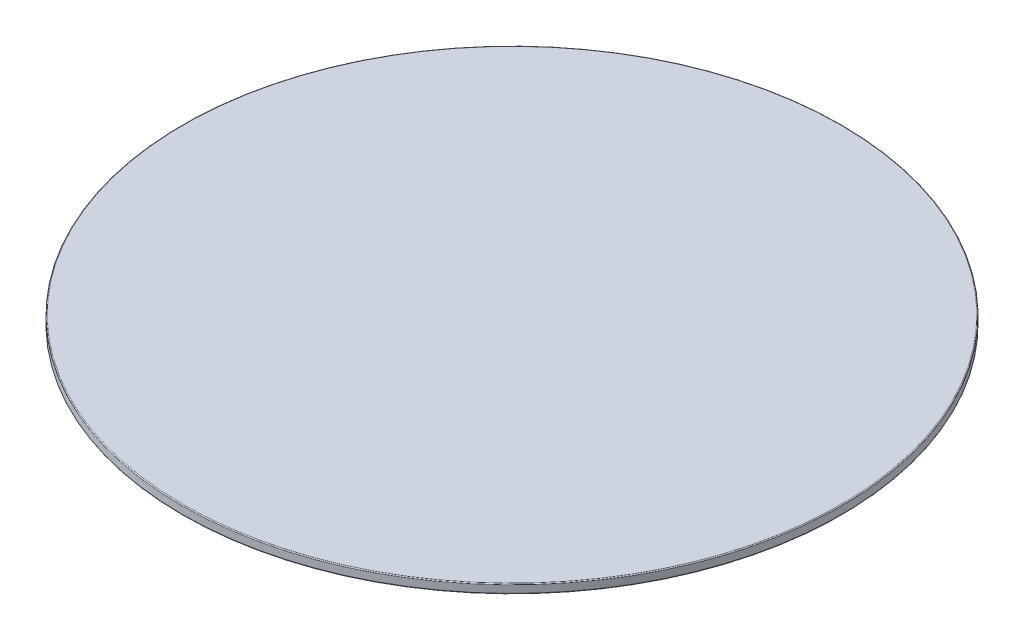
from build123d import *

# Parameters (mm, degrees)
CROQUIS1_R              = 72.5
SALIENTE_EXTRUIR1_DEPTH = 2
REDONDEO1_R             = 0.2
CROQUIS2_R              = 11
CROQUIS2_R_2            = 7.5
SALIENTE_EXTRUIR2_DEPTH = 4
REDONDEO2_R             = 0.2


with BuildPart() as part:
    # Croquis1 → Saliente-Extruir1 (new body)
    with BuildSketch(Plane(origin=(0, 0, 0), x_dir=(1, 0, 0), z_dir=(0, 1, 0))):
        with Locations(Location((0, 0, 0), (0, 0, 270))):
            Circle(CROQUIS1_R)
    extrude(amount=SALIENTE_EXTRUIR1_DEPTH)

    # Redondeo1
    redondeo1_edges = [part.edges().sort_by_distance(p)[0] for p in [
        (0, 0, -72.5),
        (0, 2, -72.5),
    ]]
    fillet(redondeo1_edges, radius=REDONDEO1_R)

    # Croquis2 → Saliente-Extruir2 (add)
    with BuildSketch(Plane.XZ):
        with Locations(Location((0, 0, 0), (0, 0, 90))):
            Circle(CROQUIS2_R)
        with Locations(Location((0, 0, 0), (0, 0, 270))):
            Circle(CROQUIS2_R_2, mode=Mode.SUBTRACT)
    extrude(amount=SALIENTE_EXTRUIR2_DEPTH)

    # Redondeo2
    redondeo2_edges = [part.edges().sort_by_distance(p)[0] for p in [
        (0, 0, -11),
        (0, -4, 7.5),
        (0, -4, -11),
    ]]
    fillet(redondeo2_edges, radius=REDONDEO2_R)


solid = part.part
